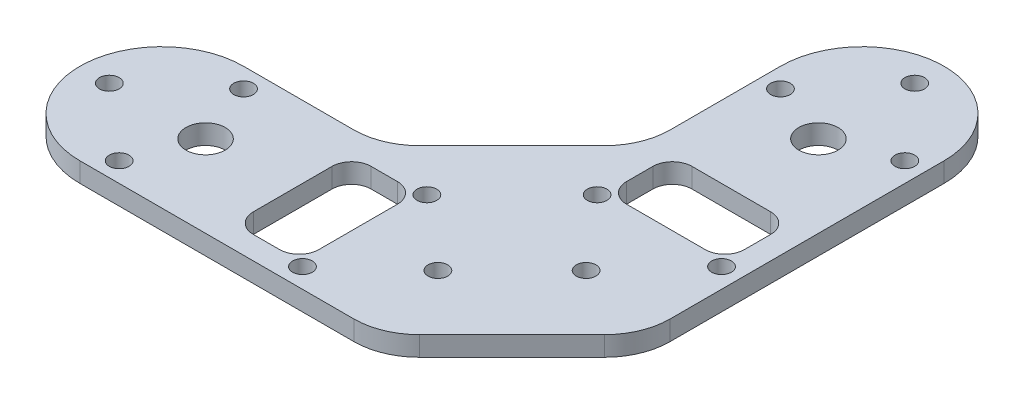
from build123d import *

# Parameters (mm, degrees)
EXTRUDE_1_DEPTH     = 3
CHAMFER_1_SIZE      = 20
FILLET_1_R          = 10
SKETCH_2_R          = 1.5
CUT_EXTRUDE_1_DEPTH = 94.386294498
SKETCH_3_R          = 3
CUT_EXTRUDE_2_DEPTH = 94.386294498
EXTRUDE_2_DEPTH     = 3
SKETCH_5_R          = 1.5
CUT_EXTRUDE_3_DEPTH = 103.602387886


with BuildPart() as part:
    # Sketch 1 → Extrude 1 (new body)
    with BuildSketch(Plane(origin=(0, 0, 0), x_dir=(1, 0, 0), z_dir=(0, 1, 0))):
        Polygon((0, 0), (0, 25), (41, 25), (41, 66), (66, 66), (66, 0), align=None)
    extrude(amount=EXTRUDE_1_DEPTH)

    # Chamfer 1
    chamfer_1_edges = [part.edges().sort_by_distance(p)[0] for p in [
        (41, 1.5, -25),
        (66, 1.5, 0),
    ]]
    chamfer(chamfer_1_edges, length=CHAMFER_1_SIZE)

    # Fillet 1
    fillet_1_edges = [part.edges().sort_by_distance(p)[0] for p in [
        (66, 1.5, -20),
        (46, 1.5, 0),
        (21, 1.5, -25),
        (41, 1.5, -45),
    ]]
    fillet(fillet_1_edges, radius=FILLET_1_R)

    # Sketch 2 → Cut-Extrude 1 (cut, through all)
    with BuildSketch(Plane(origin=(0, 3, 0), x_dir=(1, 0, 0), z_dir=(0, 1, 0))):
        with Locations(Location((3, 22, 0), (0, 0, 270))):
            Circle(SKETCH_2_R)
        with Locations(Location((3, 3, 0), (0, 0, 270))):
            Circle(SKETCH_2_R)
        with Locations(Location((31, 3, 0), (0, 0, 270))):
            Circle(SKETCH_2_R)
        with Locations(Location((31, 22, 0), (0, 0, 270))):
            Circle(SKETCH_2_R)
        with Locations(Location((44, 35, 0), (0, 0, 270))):
            Circle(SKETCH_2_R)
        with Locations(Location((63, 35, 0), (0, 0, 270))):
            Circle(SKETCH_2_R)
        with Locations(Location((63, 63, 0), (0, 0, 270))):
            Circle(SKETCH_2_R)
        with Locations(Location((44, 63, 0), (0, 0, 270))):
            Circle(SKETCH_2_R)
    extrude(amount=-CUT_EXTRUDE_1_DEPTH, mode=Mode.SUBTRACT)

    # Sketch 3 → Cut-Extrude 2 (cut, through all)
    with BuildSketch(Plane(origin=(0, 3, 0), x_dir=(1, 0, 0), z_dir=(0, 1, 0))):
        with Locations(Location((6.7, 12.5, 0), (0, 0, 270))):
            Circle(SKETCH_3_R)
        with Locations(Location((53.5, 59.3, 0), (0, 0, 270))):
            Circle(SKETCH_3_R)
        with BuildLine():
            Line((23, 21.5), (27, 21.5))
            ThreePointArc((27, 21.5), (29.121320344, 20.621320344), (30, 18.5))
            Line((30, 18.5), (30, 6.5))
            ThreePointArc((30, 6.5), (29.121320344, 4.378679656), (27, 3.5))
            Line((27, 3.5), (23, 3.5))
            ThreePointArc((23, 3.5), (20.878679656, 4.378679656), (20, 6.5))
            Line((20, 6.5), (20, 18.5))
            ThreePointArc((20, 18.5), (20.878679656, 20.621320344), (23, 21.5))
        make_face()
        with BuildLine():
            Line((47.5, 46), (59.5, 46))
            ThreePointArc((59.5, 46), (61.621320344, 45.121320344), (62.5, 43))
            Line((62.5, 43), (62.5, 39))
            ThreePointArc((62.5, 39), (61.621320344, 36.878679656), (59.5, 36))
            Line((59.5, 36), (47.5, 36))
            ThreePointArc((47.5, 36), (45.378679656, 36.878679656), (44.5, 39))
            Line((44.5, 39), (44.5, 43))
            ThreePointArc((44.5, 43), (45.378679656, 45.121320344), (47.5, 46))
        make_face()
    extrude(amount=-CUT_EXTRUDE_2_DEPTH, mode=Mode.SUBTRACT)

    # Sketch 4 → Extrude 2 (add, through all)
    with BuildSketch(Plane(origin=(0, 3, 0), x_dir=(1, 0, 0), z_dir=(0, 1, 0))):
        with BuildLine():
            Line((0, 0), (0, 25))
            ThreePointArc((0, 25), (-12.5, 12.5), (0, 0))
        make_face()
        with BuildLine():
            Line((41, 66), (66, 66))
            ThreePointArc((66, 66), (53.5, 78.5), (41, 66))
        make_face()
    extrude(amount=-EXTRUDE_2_DEPTH)

    # Sketch 5 → Cut-Extrude 3 (cut, through all)
    with BuildSketch(Plane(origin=(0, 3, 0), x_dir=(1, 0, 0), z_dir=(0, 1, 0))):
        with Locations(Location((53.5, 74, 0), (0, 0, 270))):
            Circle(SKETCH_5_R)
        with Locations(Location((-8, 12.5, 0), (0, 0, 270))):
            Circle(SKETCH_5_R)
        with Locations(Location((53.171572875, 24.142135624, 0), (0, 0, 270))):
            Circle(SKETCH_5_R)
        with Locations(Location((41.857864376, 12.828427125, 0), (0, 0, 270))):
            Circle(SKETCH_5_R)
    extrude(amount=-CUT_EXTRUDE_3_DEPTH, mode=Mode.SUBTRACT)


solid = part.part
